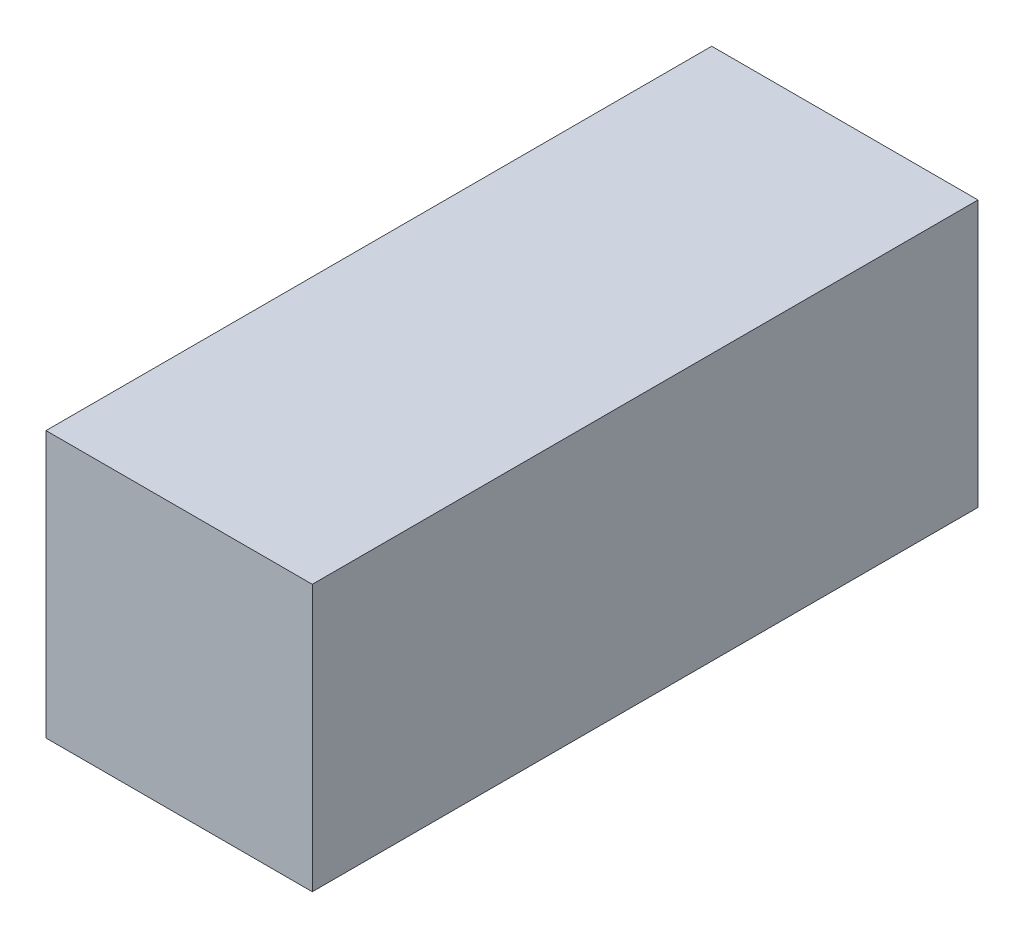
from build123d import *

# Parameters (mm, degrees)
SKIZZE1_W                       = 40
SKIZZE1_H                       = 40
AUFSATZ_LINEAR_AUSTRAGEN1_DEPTH = 100


with BuildPart() as part:
    # Skizze1 → Aufsatz-Linear austragen1 (new body)
    with BuildSketch(Plane.XY):
        with Locations((-20, -20)):
            Rectangle(SKIZZE1_W, SKIZZE1_H)
    extrude(amount=AUFSATZ_LINEAR_AUSTRAGEN1_DEPTH)


solid = part.part
